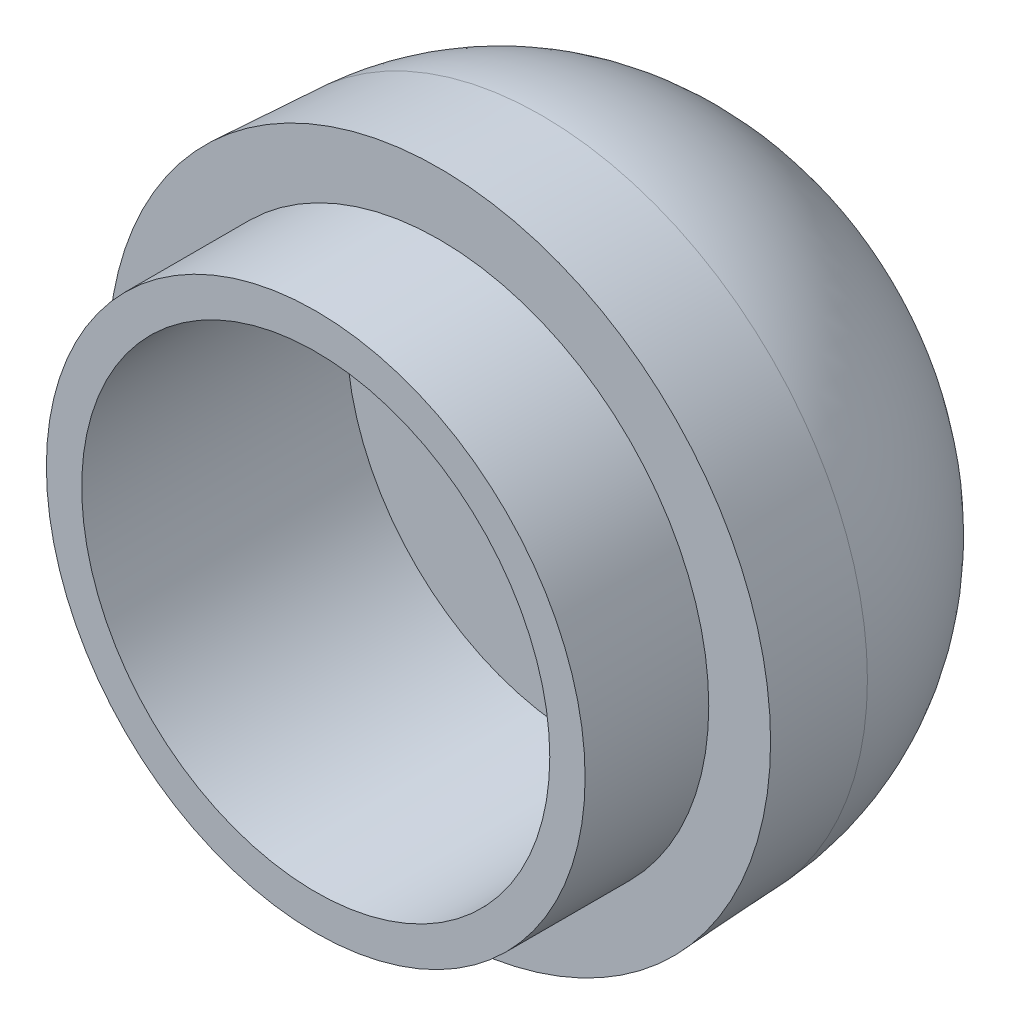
ISO-10303-21;
HEADER;
FILE_DESCRIPTION(('STEP AP214'),'2;1');
FILE_NAME('part.step','',(''),(''),'','','');
FILE_SCHEMA(('AUTOMOTIVE_DESIGN { 1 0 10303 214 1 1 1 1 }'));
ENDSEC;
DATA;
#1=APPLICATION_CONTEXT('core data for automotive mechanical design processes');
#2=APPLICATION_PROTOCOL_DEFINITION('international standard','automotive_design',2000,#1);
#3=PRODUCT_CONTEXT('',#1,'mechanical');
#4=PRODUCT('Part','Part','',(#3));
#5=PRODUCT_RELATED_PRODUCT_CATEGORY('part','',(#4));
#6=PRODUCT_DEFINITION_FORMATION('','',#4);
#7=PRODUCT_DEFINITION_CONTEXT('part definition',#1,'design');
#8=PRODUCT_DEFINITION('design','',#6,#7);
#9=PRODUCT_DEFINITION_SHAPE('','',#8);
#10=(LENGTH_UNIT() NAMED_UNIT(*) SI_UNIT(.MILLI.,.METRE.));
#11=(NAMED_UNIT(*) PLANE_ANGLE_UNIT() SI_UNIT($,.RADIAN.));
#12=(NAMED_UNIT(*) SI_UNIT($,.STERADIAN.) SOLID_ANGLE_UNIT());
#13=UNCERTAINTY_MEASURE_WITH_UNIT(LENGTH_MEASURE(1.E-05),#10,'distance_accuracy_value','');
#14=(GEOMETRIC_REPRESENTATION_CONTEXT(3) GLOBAL_UNCERTAINTY_ASSIGNED_CONTEXT((#13)) GLOBAL_UNIT_ASSIGNED_CONTEXT((#10,
#11,#12)) REPRESENTATION_CONTEXT('',''));
#15=CARTESIAN_POINT('',(0.,0.,0.));
#16=DIRECTION('',(0.,0.,1.));
#17=DIRECTION('',(1.,0.,0.));
#18=AXIS2_PLACEMENT_3D('',#15,#16,#17);
#19=CARTESIAN_POINT('',(0.,0.,0.));
#20=DIRECTION('',(0.,0.,1.));
#21=DIRECTION('',(1.,0.,0.));
#22=AXIS2_PLACEMENT_3D('',#19,#20,#21);
#23=PLANE('',#22);
#24=CARTESIAN_POINT('',(0.,0.,0.));
#25=DIRECTION('',(0.,0.,1.));
#26=DIRECTION('',(1.,0.,0.));
#27=AXIS2_PLACEMENT_3D('',#24,#25,#26);
#28=CIRCLE('',#27,4.7625);
#29=CARTESIAN_POINT('',(4.7625,0.,0.));
#30=VERTEX_POINT('',#29);
#31=EDGE_CURVE('E37',#30,#30,#28,.T.);
#32=ORIENTED_EDGE('',*,*,#31,.T.);
#33=EDGE_LOOP('',(#32));
#34=FACE_BOUND('',#33,.T.);
#35=CARTESIAN_POINT('',(0.,0.,0.));
#36=DIRECTION('',(0.,0.,1.));
#37=DIRECTION('',(1.,0.,0.));
#38=AXIS2_PLACEMENT_3D('',#35,#36,#37);
#39=CIRCLE('',#38,3.8735);
#40=CARTESIAN_POINT('',(3.8735,0.,0.));
#41=VERTEX_POINT('',#40);
#42=EDGE_CURVE('E46',#41,#41,#39,.T.);
#43=ORIENTED_EDGE('',*,*,#42,.F.);
#44=EDGE_LOOP('',(#43));
#45=FACE_BOUND('',#44,.T.);
#46=ADVANCED_FACE('F26',(#34,#45),#23,.T.);
#47=CARTESIAN_POINT('',(0.,0.,0.));
#48=DIRECTION('',(0.,0.,1.));
#49=DIRECTION('',(1.,0.,0.));
#50=AXIS2_PLACEMENT_3D('',#47,#48,#49);
#51=CONICAL_SURFACE('',#50,4.7625,0.05235987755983);
#52=CARTESIAN_POINT('',(0.,0.,-1.46939999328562));
#53=DIRECTION('',(0.,0.,1.));
#54=DIRECTION('',(1.,0.,0.));
#55=AXIS2_PLACEMENT_3D('',#52,#53,#54);
#56=CIRCLE('',#55,4.68549200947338);
#57=CARTESIAN_POINT('',(4.68549200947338,0.,-1.46939999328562));
#58=VERTEX_POINT('',#57);
#59=EDGE_CURVE('E33',#58,#58,#56,.T.);
#60=ORIENTED_EDGE('',*,*,#59,.T.);
#61=EDGE_LOOP('',(#60));
#62=FACE_BOUND('',#61,.T.);
#63=ORIENTED_EDGE('',*,*,#31,.F.);
#64=EDGE_LOOP('',(#63));
#65=FACE_BOUND('',#64,.T.);
#66=ADVANCED_FACE('F28',(#62,#65),#51,.T.);
#67=CARTESIAN_POINT('',(0.,0.,-5.08));
#68=DIRECTION('',(0.,0.,1.));
#69=DIRECTION('',(1.,0.,0.));
#70=AXIS2_PLACEMENT_3D('',#67,#68,#69);
#71=PLANE('',#70);
#72=CARTESIAN_POINT('',(0.,0.,-5.08));
#73=DIRECTION('',(0.,0.,1.));
#74=DIRECTION('',(1.,0.,0.));
#75=AXIS2_PLACEMENT_3D('',#72,#73,#74);
#76=CIRCLE('',#75,0.880713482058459);
#77=CARTESIAN_POINT('',(0.880713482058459,0.,-5.08));
#78=VERTEX_POINT('',#77);
#79=EDGE_CURVE('E10',#78,#78,#76,.F.);
#80=ORIENTED_EDGE('',*,*,#79,.T.);
#81=EDGE_LOOP('',(#80));
#82=FACE_BOUND('',#81,.T.);
#83=ADVANCED_FACE('F78',(#82),#71,.F.);
#84=CARTESIAN_POINT('',(0.,0.,-1.27));
#85=DIRECTION('',(0.,0.,1.));
#86=DIRECTION('',(1.,0.,0.));
#87=AXIS2_PLACEMENT_3D('',#84,#85,#86);
#88=DEGENERATE_TOROIDAL_SURFACE('',#87,0.880713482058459,3.81,.T.);
#89=ORIENTED_EDGE('',*,*,#79,.F.);
#90=EDGE_LOOP('',(#89));
#91=FACE_BOUND('',#90,.T.);
#92=ORIENTED_EDGE('',*,*,#59,.F.);
#93=EDGE_LOOP('',(#92));
#94=FACE_BOUND('',#93,.T.);
#95=ADVANCED_FACE('F67',(#91,#94),#88,.T.);
#96=CARTESIAN_POINT('',(0.,0.,1.778));
#97=DIRECTION('',(0.,0.,-1.));
#98=DIRECTION('',(-1.,0.,0.));
#99=AXIS2_PLACEMENT_3D('',#96,#97,#98);
#100=CYLINDRICAL_SURFACE('',#99,3.8735);
#101=CARTESIAN_POINT('',(0.,0.,1.778));
#102=DIRECTION('',(0.,0.,1.));
#103=DIRECTION('',(1.,0.,0.));
#104=AXIS2_PLACEMENT_3D('',#101,#102,#103);
#105=CIRCLE('',#104,3.8735);
#106=CARTESIAN_POINT('',(3.8735,0.,1.778));
#107=VERTEX_POINT('',#106);
#108=EDGE_CURVE('E41',#107,#107,#105,.T.);
#109=ORIENTED_EDGE('',*,*,#108,.F.);
#110=EDGE_LOOP('',(#109));
#111=FACE_BOUND('',#110,.T.);
#112=ORIENTED_EDGE('',*,*,#42,.T.);
#113=EDGE_LOOP('',(#112));
#114=FACE_BOUND('',#113,.T.);
#115=ADVANCED_FACE('F61',(#111,#114),#100,.T.);
#116=CARTESIAN_POINT('',(0.,0.,1.778));
#117=DIRECTION('',(0.,0.,1.));
#118=DIRECTION('',(1.,0.,0.));
#119=AXIS2_PLACEMENT_3D('',#116,#117,#118);
#120=PLANE('',#119);
#121=CARTESIAN_POINT('',(0.,0.,1.778));
#122=DIRECTION('',(0.,0.,1.));
#123=DIRECTION('',(1.,0.,0.));
#124=AXIS2_PLACEMENT_3D('',#121,#122,#123);
#125=CIRCLE('',#124,3.3655);
#126=CARTESIAN_POINT('',(3.3655,0.,1.778));
#127=VERTEX_POINT('',#126);
#128=EDGE_CURVE('E52',#127,#127,#125,.T.);
#129=ORIENTED_EDGE('',*,*,#128,.F.);
#130=EDGE_LOOP('',(#129));
#131=FACE_BOUND('',#130,.T.);
#132=ORIENTED_EDGE('',*,*,#108,.T.);
#133=EDGE_LOOP('',(#132));
#134=FACE_BOUND('',#133,.T.);
#135=ADVANCED_FACE('F58',(#131,#134),#120,.T.);
#136=CARTESIAN_POINT('',(0.,0.,-2.032));
#137=DIRECTION('',(0.,0.,1.));
#138=DIRECTION('',(1.,0.,0.));
#139=AXIS2_PLACEMENT_3D('',#136,#137,#138);
#140=CYLINDRICAL_SURFACE('',#139,3.3655);
#141=CARTESIAN_POINT('',(0.,0.,-2.032));
#142=DIRECTION('',(0.,0.,1.));
#143=DIRECTION('',(1.,0.,0.));
#144=AXIS2_PLACEMENT_3D('',#141,#142,#143);
#145=CIRCLE('',#144,3.3655);
#146=CARTESIAN_POINT('',(3.3655,0.,-2.032));
#147=VERTEX_POINT('',#146);
#148=EDGE_CURVE('E49',#147,#147,#145,.T.);
#149=CARTESIAN_POINT('',(3.3655,0.,-2.032));
#150=CARTESIAN_POINT('',(3.3655,0.,-1.9923125));
#151=CARTESIAN_POINT('',(3.3655,0.,-1.952625));
#152=CARTESIAN_POINT('',(3.3655,0.,-1.87325));
#153=CARTESIAN_POINT('',(3.3655,0.,-1.8335625));
#154=CARTESIAN_POINT('',(3.3655,0.,-1.7541875));
#155=CARTESIAN_POINT('',(3.3655,0.,-1.7145));
#156=CARTESIAN_POINT('',(3.3655,0.,-1.635125));
#157=CARTESIAN_POINT('',(3.3655,0.,-1.5954375));
#158=CARTESIAN_POINT('',(3.3655,0.,-1.5160625));
#159=CARTESIAN_POINT('',(3.3655,0.,-1.476375));
#160=CARTESIAN_POINT('',(3.3655,0.,-1.397));
#161=CARTESIAN_POINT('',(3.3655,0.,-1.3573125));
#162=CARTESIAN_POINT('',(3.3655,0.,-1.2779375));
#163=CARTESIAN_POINT('',(3.3655,0.,-1.23825));
#164=CARTESIAN_POINT('',(3.3655,0.,-1.158875));
#165=CARTESIAN_POINT('',(3.3655,0.,-1.1191875));
#166=CARTESIAN_POINT('',(3.3655,0.,-1.0398125));
#167=CARTESIAN_POINT('',(3.3655,0.,-1.000125));
#168=CARTESIAN_POINT('',(3.3655,0.,-0.92075));
#169=CARTESIAN_POINT('',(3.3655,0.,-0.8810625));
#170=CARTESIAN_POINT('',(3.3655,0.,-0.8016875));
#171=CARTESIAN_POINT('',(3.3655,0.,-0.762));
#172=CARTESIAN_POINT('',(3.3655,0.,-0.682625));
#173=CARTESIAN_POINT('',(3.3655,0.,-0.6429375));
#174=CARTESIAN_POINT('',(3.3655,0.,-0.5635625));
#175=CARTESIAN_POINT('',(3.3655,0.,-0.523875));
#176=CARTESIAN_POINT('',(3.3655,0.,-0.4445));
#177=CARTESIAN_POINT('',(3.3655,0.,-0.4048125));
#178=CARTESIAN_POINT('',(3.3655,0.,-0.3254375));
#179=CARTESIAN_POINT('',(3.3655,0.,-0.28575));
#180=CARTESIAN_POINT('',(3.3655,0.,-0.206375));
#181=CARTESIAN_POINT('',(3.3655,0.,-0.1666875));
#182=CARTESIAN_POINT('',(3.3655,0.,-0.0873124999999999));
#183=CARTESIAN_POINT('',(3.3655,0.,-0.047625));
#184=CARTESIAN_POINT('',(3.3655,0.,0.0317499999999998));
#185=CARTESIAN_POINT('',(3.3655,0.,0.0714374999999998));
#186=CARTESIAN_POINT('',(3.3655,0.,0.1508125));
#187=CARTESIAN_POINT('',(3.3655,0.,0.1905));
#188=CARTESIAN_POINT('',(3.3655,0.,0.269875));
#189=CARTESIAN_POINT('',(3.3655,0.,0.3095625));
#190=CARTESIAN_POINT('',(3.3655,0.,0.3889375));
#191=CARTESIAN_POINT('',(3.3655,0.,0.428625));
#192=CARTESIAN_POINT('',(3.3655,0.,0.508));
#193=CARTESIAN_POINT('',(3.3655,0.,0.5476875));
#194=CARTESIAN_POINT('',(3.3655,0.,0.6270625));
#195=CARTESIAN_POINT('',(3.3655,0.,0.66675));
#196=CARTESIAN_POINT('',(3.3655,0.,0.746125));
#197=CARTESIAN_POINT('',(3.3655,0.,0.7858125));
#198=CARTESIAN_POINT('',(3.3655,0.,0.8651875));
#199=CARTESIAN_POINT('',(3.3655,0.,0.904875));
#200=CARTESIAN_POINT('',(3.3655,0.,0.98425));
#201=CARTESIAN_POINT('',(3.3655,0.,1.0239375));
#202=CARTESIAN_POINT('',(3.3655,0.,1.1033125));
#203=CARTESIAN_POINT('',(3.3655,0.,1.143));
#204=CARTESIAN_POINT('',(3.3655,0.,1.222375));
#205=CARTESIAN_POINT('',(3.3655,0.,1.2620625));
#206=CARTESIAN_POINT('',(3.3655,0.,1.3414375));
#207=CARTESIAN_POINT('',(3.3655,0.,1.381125));
#208=CARTESIAN_POINT('',(3.3655,0.,1.4605));
#209=CARTESIAN_POINT('',(3.3655,0.,1.5001875));
#210=CARTESIAN_POINT('',(3.3655,0.,1.5795625));
#211=CARTESIAN_POINT('',(3.3655,0.,1.61925));
#212=CARTESIAN_POINT('',(3.3655,0.,1.698625));
#213=CARTESIAN_POINT('',(3.3655,0.,1.7383125));
#214=CARTESIAN_POINT('',(3.3655,0.,1.778));
#215=B_SPLINE_CURVE_WITH_KNOTS('',3,(#149,#150,#151,#152,#153,#154,#155,#156,#157,#158,#159,
#160,#161,#162,#163,#164,#165,#166,#167,#168,#169,#170,#171,#172,#173,#174,#175,#176,#177,#178,
#179,#180,#181,#182,#183,#184,#185,#186,#187,#188,#189,#190,#191,#192,#193,#194,#195,#196,#197,
#198,#199,#200,#201,#202,#203,#204,#205,#206,#207,#208,#209,#210,#211,#212,#213,#214),
.UNSPECIFIED.,.F.,.F.,(4,2,2,2,2,2,2,2,2,2,2,2,2,2,2,2,2,2,2,2,2,2,2,2,2,2,2,2,2,2,2,2,4),(0.,
0.1190625,0.238125,0.3571875,0.47625,0.5953125,0.714375,0.8334375,0.9525,1.0715625,1.190625,
1.3096875,1.42875,1.5478125,1.666875,1.7859375,1.905,2.0240625,2.143125,2.2621875,2.38125,
2.5003125,2.619375,2.7384375,2.8575,2.9765625,3.095625,3.2146875,3.33375,3.4528125,3.571875,
3.6909375,3.81),.UNSPECIFIED.);
#216=EDGE_CURVE('BSEAM56',#147,#127,#215,.T.);
#217=ORIENTED_EDGE('',*,*,#148,.F.);
#218=ORIENTED_EDGE('',*,*,#128,.T.);
#219=ORIENTED_EDGE('',*,*,#216,.T.);
#220=ORIENTED_EDGE('',*,*,#216,.F.);
#221=EDGE_LOOP('',(#217,#219,#218,#220));
#222=FACE_BOUND('',#221,.T.);
#223=ADVANCED_FACE('F56',(#222),#140,.F.);
#224=CARTESIAN_POINT('',(0.,0.,-2.032));
#225=DIRECTION('',(0.,0.,1.));
#226=DIRECTION('',(1.,0.,0.));
#227=AXIS2_PLACEMENT_3D('',#224,#225,#226);
#228=PLANE('',#227);
#229=ORIENTED_EDGE('',*,*,#148,.T.);
#230=EDGE_LOOP('',(#229));
#231=FACE_BOUND('',#230,.T.);
#232=ADVANCED_FACE('F107',(#231),#228,.T.);
#233=CLOSED_SHELL('',(#46,#66,#83,#95,#115,#135,#223,#232));
#234=MANIFOLD_SOLID_BREP('B2',#233);
#235=ADVANCED_BREP_SHAPE_REPRESENTATION('',(#18,#234),#14);
#236=SHAPE_DEFINITION_REPRESENTATION(#9,#235);
ENDSEC;
END-ISO-10303-21;
